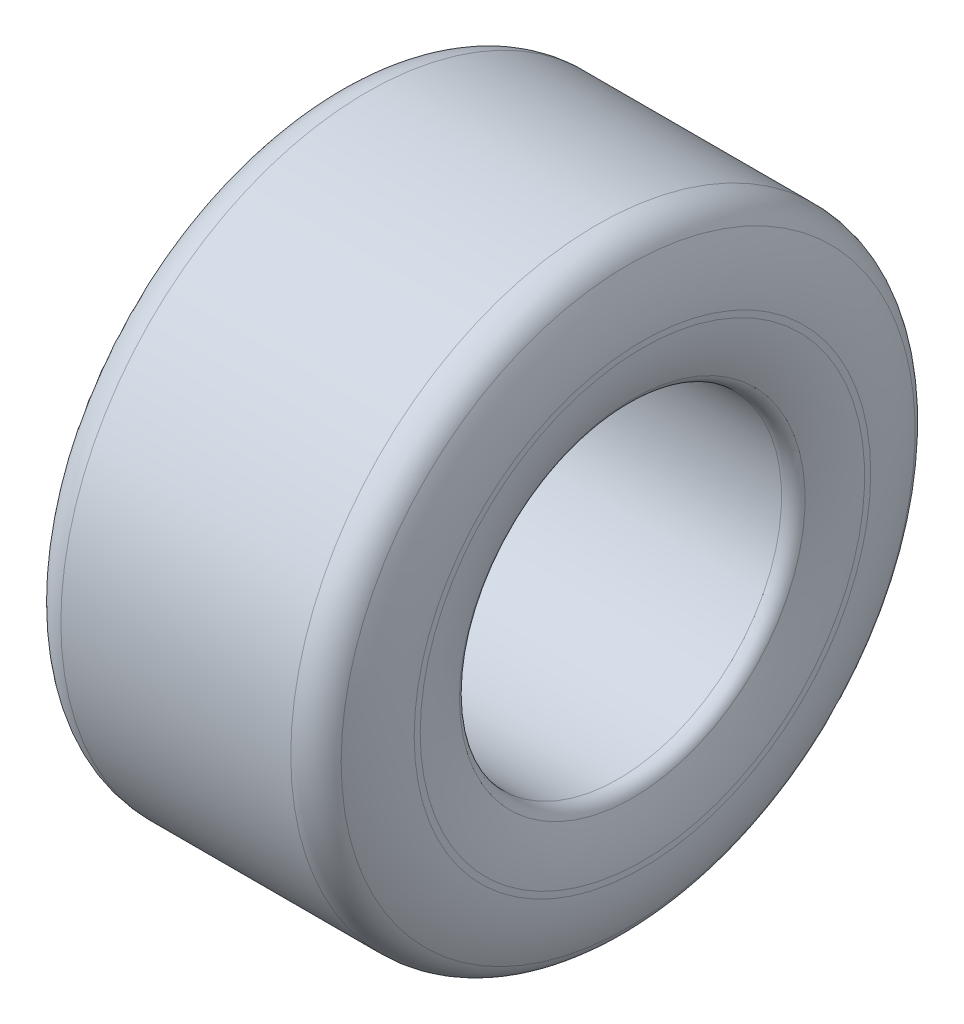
from build123d import *


with BuildPart() as part:
    # Sketch1 → Revolve1 (revolve)
    with BuildSketch(Plane.XY, mode=Mode.PRIVATE) as revolve1_sk:
        with BuildLine():
            Line((57.15, 68.58), (-57.15, 68.58))
            ThreePointArc((-57.15, 68.58), (-60.699143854, 69.664444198), (-63.036051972, 72.547377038))
            ThreePointArc((-63.036051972, 72.547377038), (-66.117099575, 82.727722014), (-67.31, 93.296982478))
            Line((-67.31, 93.296982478), (-67.31, 95.836982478))
            ThreePointArc((-67.31, 95.836982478), (-65.649865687, 108.483216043), (-61.296662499, 120.472081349))
            ThreePointArc((-61.296662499, 120.472081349), (-55.938127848, 126.392895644), (-48.26, 128.5875))
            Line((-48.26, 128.5875), (48.26, 128.5875))
            ThreePointArc((48.26, 128.5875), (55.938127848, 126.392895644), (61.296662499, 120.472081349))
            ThreePointArc((61.296662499, 120.472081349), (65.649865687, 108.483216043), (67.31, 95.836982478))
            Line((67.31, 95.836982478), (67.31, 93.296982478))
            ThreePointArc((67.31, 93.296982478), (66.117099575, 82.727722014), (63.036051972, 72.547377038))
            ThreePointArc((63.036051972, 72.547377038), (60.699143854, 69.664444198), (57.15, 68.58))
        make_face()
    revolve(revolve1_sk.sketch.rotate(Axis((0, 0, 0), (1, 0, 0)), 90), axis=Axis((0, 0, 0), (1, 0, 0)))


solid = part.part
